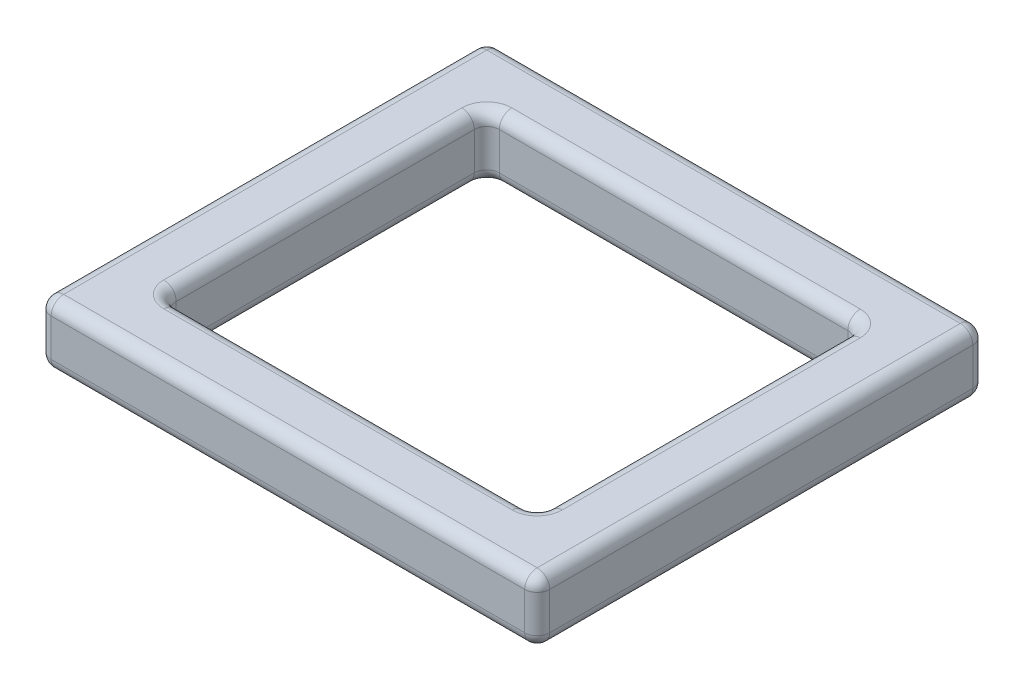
from build123d import *

# Parameters (mm, degrees)
SKETCH1_W      = 79.70776103
SKETCH1_H      = 71.652189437
SKETCH1_W_2    = 59.70776103
SKETCH1_H_2    = 51.652189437
EXTRUDE1_DEPTH = 10
FILLET1_R      = 2


with BuildPart() as part:
    # Sketch1 → Extrude1 (new body)
    with BuildSketch(Plane(origin=(0, 0, 0), x_dir=(1, 0, 0), z_dir=(0, 1, 0))):
        with Locations((-2.013892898, -0.953949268)):
            Rectangle(SKETCH1_W, SKETCH1_H)
        with Locations((-2.013892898, -0.953949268)):
            Rectangle(SKETCH1_W_2, SKETCH1_H_2, mode=Mode.SUBTRACT)
    extrude(amount=EXTRUDE1_DEPTH)

    # Fillet1
    fillet1_edges = [part.edges().sort_by_distance(p)[0] for p in [
        (-41.867773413, 5, -34.872145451),
        (37.839987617, 5, -34.872145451),
        (-2.013892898, 0, -34.872145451),
        (-2.013892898, 10, -34.872145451),
        (37.839987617, 5, 36.780043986),
        (37.839987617, 0, 0.953949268),
        (37.839987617, 10, 0.953949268),
        (-41.867773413, 5, 36.780043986),
        (-2.013892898, 0, 36.780043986),
        (-2.013892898, 10, 36.780043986),
        (-41.867773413, 0, 0.953949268),
        (-41.867773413, 10, 0.953949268),
        (-31.867773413, 5, -24.872145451),
        (-31.867773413, 5, 26.780043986),
        (-31.867773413, 0, 0.953949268),
        (-31.867773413, 10, 0.953949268),
        (27.839987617, 5, 26.780043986),
        (-2.013892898, 0, 26.780043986),
        (-2.013892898, 10, 26.780043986),
        (27.839987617, 5, -24.872145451),
        (27.839987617, 0, 0.953949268),
        (27.839987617, 10, 0.953949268),
        (-2.013892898, 0, -24.872145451),
        (-2.013892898, 10, -24.872145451),
    ]]
    fillet(fillet1_edges, radius=FILLET1_R)


solid = part.part
